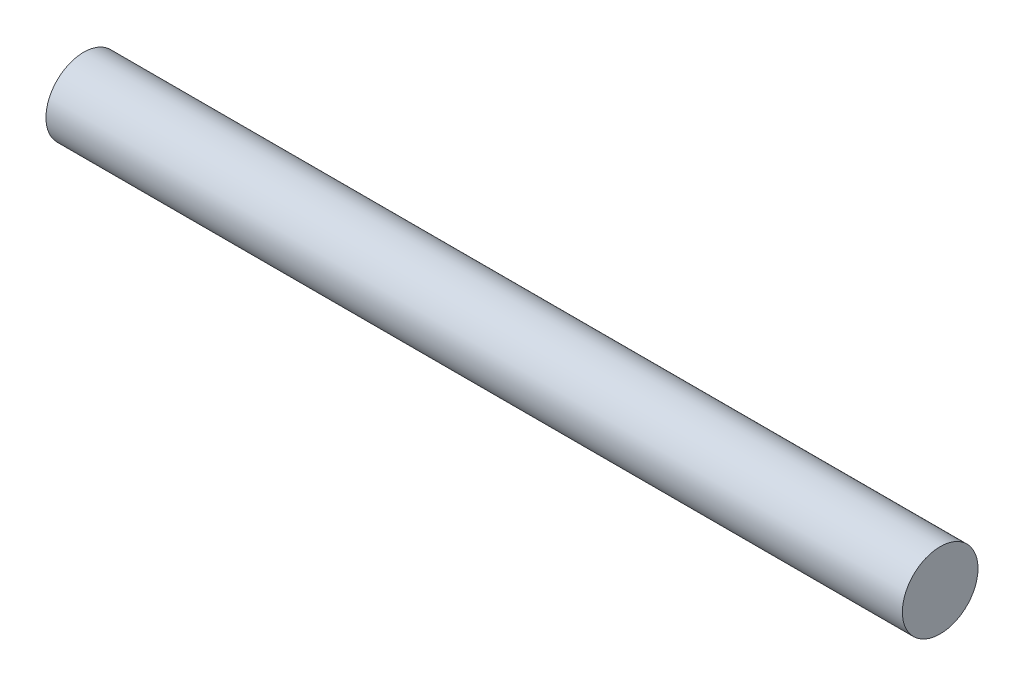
ISO-10303-21;
HEADER;
FILE_DESCRIPTION(('STEP AP214'),'2;1');
FILE_NAME('part.step','',(''),(''),'','','');
FILE_SCHEMA(('AUTOMOTIVE_DESIGN { 1 0 10303 214 1 1 1 1 }'));
ENDSEC;
DATA;
#1=APPLICATION_CONTEXT('core data for automotive mechanical design processes');
#2=APPLICATION_PROTOCOL_DEFINITION('international standard','automotive_design',2000,#1);
#3=PRODUCT_CONTEXT('',#1,'mechanical');
#4=PRODUCT('Part','Part','',(#3));
#5=PRODUCT_RELATED_PRODUCT_CATEGORY('part','',(#4));
#6=PRODUCT_DEFINITION_FORMATION('','',#4);
#7=PRODUCT_DEFINITION_CONTEXT('part definition',#1,'design');
#8=PRODUCT_DEFINITION('design','',#6,#7);
#9=PRODUCT_DEFINITION_SHAPE('','',#8);
#10=(LENGTH_UNIT() NAMED_UNIT(*) SI_UNIT(.MILLI.,.METRE.));
#11=(NAMED_UNIT(*) PLANE_ANGLE_UNIT() SI_UNIT($,.RADIAN.));
#12=(NAMED_UNIT(*) SI_UNIT($,.STERADIAN.) SOLID_ANGLE_UNIT());
#13=UNCERTAINTY_MEASURE_WITH_UNIT(LENGTH_MEASURE(1.E-05),#10,'distance_accuracy_value','');
#14=(GEOMETRIC_REPRESENTATION_CONTEXT(3) GLOBAL_UNCERTAINTY_ASSIGNED_CONTEXT((#13)) GLOBAL_UNIT_ASSIGNED_CONTEXT((#10,
#11,#12)) REPRESENTATION_CONTEXT('',''));
#15=CARTESIAN_POINT('',(0.,0.,0.));
#16=DIRECTION('',(0.,0.,1.));
#17=DIRECTION('',(1.,0.,0.));
#18=AXIS2_PLACEMENT_3D('',#15,#16,#17);
#19=CARTESIAN_POINT('',(0.,0.,0.));
#20=DIRECTION('',(1.,0.,0.));
#21=DIRECTION('',(0.,0.,-1.));
#22=AXIS2_PLACEMENT_3D('',#19,#20,#21);
#23=PLANE('',#22);
#24=CARTESIAN_POINT('',(0.,0.,0.));
#25=DIRECTION('',(1.,0.,0.));
#26=DIRECTION('',(0.,0.,-1.));
#27=AXIS2_PLACEMENT_3D('',#24,#25,#26);
#28=CIRCLE('',#27,2.65);
#29=CARTESIAN_POINT('',(0.,0.,-2.65));
#30=VERTEX_POINT('',#29);
#31=EDGE_CURVE('E18',#30,#30,#28,.T.);
#32=ORIENTED_EDGE('',*,*,#31,.F.);
#33=EDGE_LOOP('',(#32));
#34=FACE_BOUND('',#33,.T.);
#35=ADVANCED_FACE('F14',(#34),#23,.F.);
#36=CARTESIAN_POINT('',(60.,0.,0.));
#37=DIRECTION('',(1.,0.,0.));
#38=DIRECTION('',(0.,0.,-1.));
#39=AXIS2_PLACEMENT_3D('',#36,#37,#38);
#40=PLANE('',#39);
#41=CARTESIAN_POINT('',(60.,0.,0.));
#42=DIRECTION('',(1.,0.,0.));
#43=DIRECTION('',(0.,0.,-1.));
#44=AXIS2_PLACEMENT_3D('',#41,#42,#43);
#45=CIRCLE('',#44,2.65);
#46=CARTESIAN_POINT('',(60.,0.,-2.65));
#47=VERTEX_POINT('',#46);
#48=EDGE_CURVE('E10',#47,#47,#45,.F.);
#49=ORIENTED_EDGE('',*,*,#48,.F.);
#50=EDGE_LOOP('',(#49));
#51=FACE_BOUND('',#50,.T.);
#52=ADVANCED_FACE('F29',(#51),#40,.T.);
#53=CARTESIAN_POINT('',(0.,0.,0.));
#54=DIRECTION('',(1.,0.,0.));
#55=DIRECTION('',(0.,0.,-1.));
#56=AXIS2_PLACEMENT_3D('',#53,#54,#55);
#57=CYLINDRICAL_SURFACE('',#56,2.65);
#58=ORIENTED_EDGE('',*,*,#48,.T.);
#59=EDGE_LOOP('',(#58));
#60=FACE_BOUND('',#59,.T.);
#61=ORIENTED_EDGE('',*,*,#31,.T.);
#62=EDGE_LOOP('',(#61));
#63=FACE_BOUND('',#62,.T.);
#64=ADVANCED_FACE('F16',(#60,#63),#57,.T.);
#65=CLOSED_SHELL('',(#35,#52,#64));
#66=MANIFOLD_SOLID_BREP('B1',#65);
#67=ADVANCED_BREP_SHAPE_REPRESENTATION('',(#18,#66),#14);
#68=SHAPE_DEFINITION_REPRESENTATION(#9,#67);
ENDSEC;
END-ISO-10303-21;
